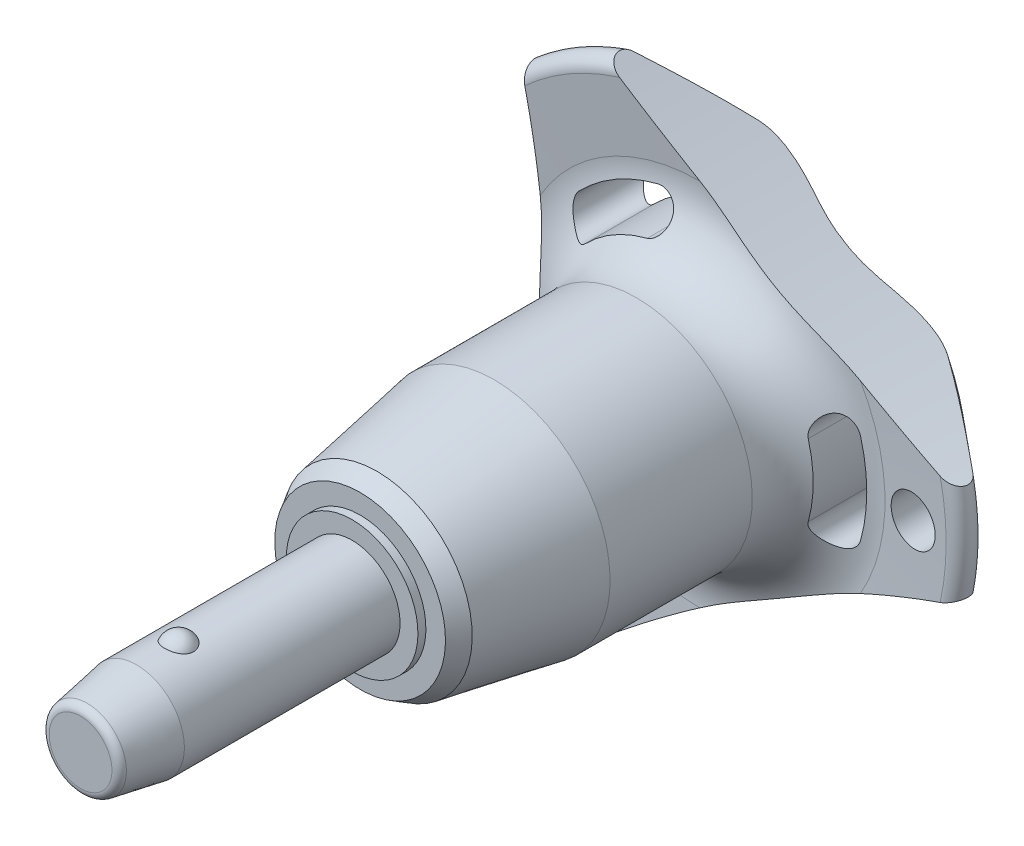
from build123d import *

# Parameters (mm, degrees)
SKETCH1_R           = 3
BOSS_EXTRUDE1_DEPTH = 10
SKETCH2_R           = 2.5
BOSS_EXTRUDE2_DEPTH = 26.7
BOSS_EXTRUDE3_START = 7
SKETCH1_2_R         = 3
BOSS_EXTRUDE3_DEPTH = 7
CHAMFER1_SIZE       = 3.5
CHAMFER1_SIZE2      = 0.617144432
FILLET1_R           = 0.5
SKETCH6_R           = 79.96
CUT_EXTRUDE1_DEPTH  = 44.566782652
CIRPATTERN1_COUNT   = 3
SKETCH7_R           = 1.5
CUT_EXTRUDE2_DEPTH  = 44.216000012


with BuildPart() as part:
    # Sketch1 → Boss-Extrude1 (new body)
    with BuildSketch(Plane.XY):
        Circle(SKETCH1_R)
    extrude(amount=-BOSS_EXTRUDE1_DEPTH)

    # Sketch2 → Boss-Extrude2 (add)
    with BuildSketch(Plane(origin=(0, 0, -10), x_dir=(-1, 0, 0), z_dir=(0, 0, -1))):
        Circle(SKETCH2_R)
    extrude(amount=BOSS_EXTRUDE2_DEPTH)

    # Sketch3 → Revolve1 (revolve)
    with BuildSketch(Plane(origin=(0, 0, 0), x_dir=(0, 0, -1), z_dir=(1, 0, 0))):
        with BuildLine():
            Line((-0.866025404, 3.5), (-0.866025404, 1.5))
            ThreePointArc((-0.866025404, 1.5), (0.133974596, 2.5), (-0.866025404, 3.5))
        make_face()
        with BuildLine():
            Line((-0.866025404, -1.5), (-0.866025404, -3.5))
            ThreePointArc((-0.866025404, -3.5), (0.133974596, -2.5), (-0.866025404, -1.5))
        make_face()
    revolve(axis=Axis((0, -1.5, 0.866025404), (0, 1, 0)))

    # Sketch1_2 → Boss-Extrude3 (add)
    with BuildSketch(Plane.XY.offset(BOSS_EXTRUDE3_START)):
        Circle(SKETCH1_2_R)
    extrude(amount=-BOSS_EXTRUDE3_DEPTH)

    # Chamfer1
    chamfer1_edges = [part.edges().sort_by_distance(p)[0] for p in [
        (-3, 0, 7),
    ]]
    chamfer1_side = [part.faces().sort_by_distance(p)[0] for p in [
        (-3, 0, -1.5),
    ]]
    chamfer(chamfer1_edges, length=CHAMFER1_SIZE, length2=CHAMFER1_SIZE2, reference=chamfer1_side[0])

    # Fillet1
    fillet1_edges = [part.edges().sort_by_distance(p)[0] for p in [
        (-2.382855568, 0, 7),
        (2.5, 0, -36.7),
    ]]
    fillet(fillet1_edges, radius=FILLET1_R)

    # Sketch4 → Revolve2 (revolve)
    with BuildSketch(Plane(origin=(0, 0, 0), x_dir=(0, 0, -1), z_dir=(1, 0, 0))):
        Polygon((10, 0), (10, 4.118359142), (10.5, 4.118359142), (10.5, 5.343400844), (11.560917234, 5.955921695), (18.9, 7.25), (27.8, 7.25), (27.8, 0), align=None)
    revolve(axis=Axis((0, 0, -27.8), (0, 0, 1)))

    # Sketch5 → Revolve3 (revolve)
    with BuildSketch(Plane(origin=(0, 0, 0), x_dir=(0, 0, -1), z_dir=(1, 0, 0)), mode=Mode.PRIVATE) as revolve3_sk:
        with BuildLine():
            Line((31.78715932, 11.570250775), (31.452568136, 15.735949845))
            ThreePointArc((31.452568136, 15.735949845), (31.946485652, 16.540188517), (32.862835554, 16.314230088))
            Line((32.862835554, 16.314230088), (36.326414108, 12.186497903))
            ThreePointArc((36.326414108, 12.186497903), (36.7, 11.109282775), (36.261488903, 10.056825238))
            ThreePointArc((36.261488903, 10.056825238), (33.289873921, 5.413681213), (32.25, 0))
            Line((32.25, 0), (27.8, 0))
            Line((27.8, 0), (27.8, 7.25))
            ThreePointArc((27.8, 7.25), (30.739473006, 8.537160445), (31.78715932, 11.570250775))
        make_face()
    revolve(revolve3_sk.sketch.rotate(Axis((0, 0, -32.25), (0, 0, 1)), 90), axis=Axis((0, 0, -32.25), (0, 0, 1)))

    # Sketch6 → Cut-Extrude1 (cut, through all)
    with BuildSketch(Plane.XY):
        with Locations((-89.76, 0)):
            Circle(SKETCH6_R)
        with BuildLine():
            ThreePointArc((10.099921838, -2.834717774), (10.490188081, 0), (10.099921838, 2.834717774))
            ThreePointArc((10.099921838, 2.834717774), (8.768180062, 3.582738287), (8.020159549, 2.250996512))
            ThreePointArc((8.020159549, 2.250996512), (8.330062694, 0), (8.020159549, -2.250996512))
            ThreePointArc((8.020159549, -2.250996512), (8.768180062, -3.582738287), (10.099921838, -2.834717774))
        make_face()
    cut_extrude1 = extrude(amount=-CUT_EXTRUDE1_DEPTH, mode=Mode.SUBTRACT)

    # CirPattern1: Cut-Extrude1 ×3 about axis
    cirpattern1_axis = Axis((0, 0, 0), (0, 0, 1))
    for i in range(1, CIRPATTERN1_COUNT):
        add(cut_extrude1.rotate(cirpattern1_axis, i * 360 / CIRPATTERN1_COUNT), mode=Mode.SUBTRACT)

    # Sketch7 → Cut-Extrude2 (cut, through all)
    with BuildSketch(Plane.XY):
        with Locations(Location((13.490188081, 0, 0), (0, 0, 225.221865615))):
            Circle(SKETCH7_R)
    extrude(amount=-CUT_EXTRUDE2_DEPTH, mode=Mode.SUBTRACT)


solid = part.part
